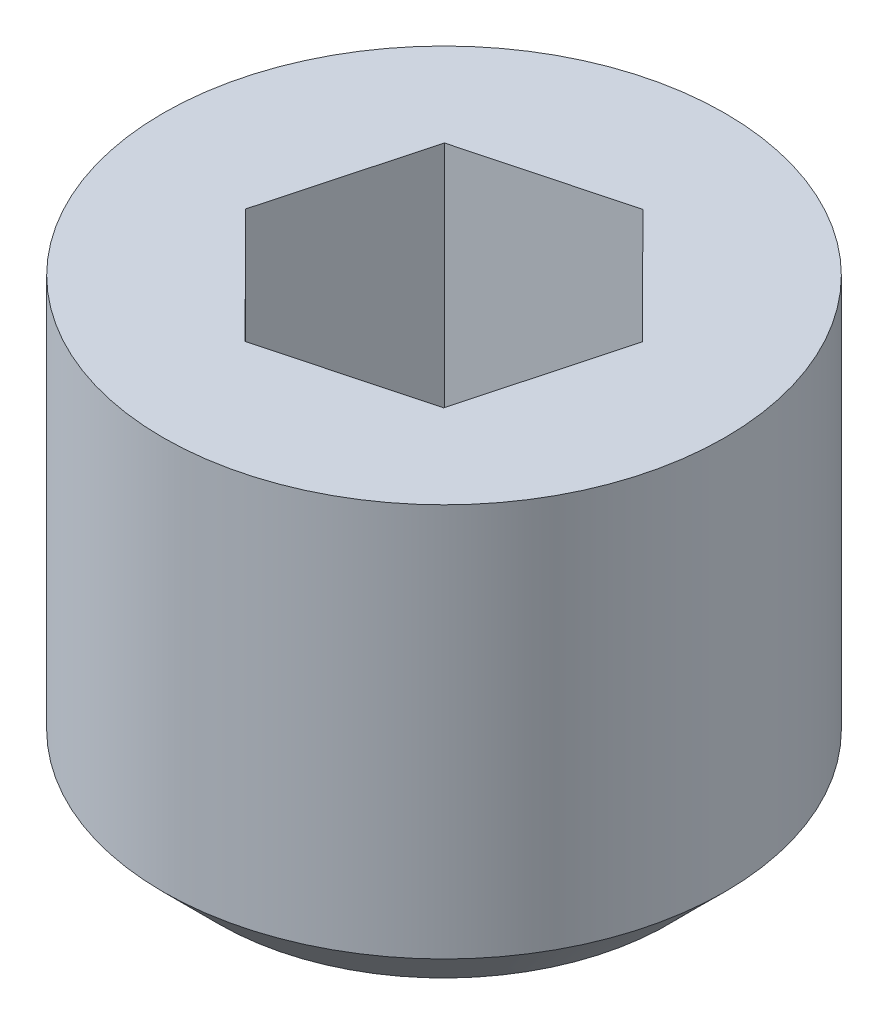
from build123d import *

# Parameters (mm, degrees)
ENL_V_MAT_EXTRU_1_DEPTH = 2.5


with BuildPart() as part:
    # Esquisse1 → R_volution1 (revolve)
    with BuildSketch(Plane.XY, mode=Mode.PRIVATE) as r_volution1_sk:
        Polygon((0, 0), (0, 4), (2.5, 4), (2.5, 0.5), (2, 0), align=None)
    revolve(r_volution1_sk.sketch.rotate(Axis((0, 0, 0), (0, 1, 0)), 90), axis=Axis((0, 0, 0), (0, 1, 0)))

    # Esquisse2 → Enl_v. mat.-Extru.1 (cut)
    with BuildSketch(Plane(origin=(0, 4, 0), x_dir=(1, 0, 0), z_dir=(0, 1, 0))):
        Polygon((1.018752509, -1.02248553), (1.394874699, 0.371022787), (0.37612219, 1.393508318), (-1.018752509, 1.02248553), (-1.394874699, -0.371022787), (-0.37612219, -1.393508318), align=None)
    extrude(amount=-ENL_V_MAT_EXTRU_1_DEPTH, mode=Mode.SUBTRACT)


solid = part.part
